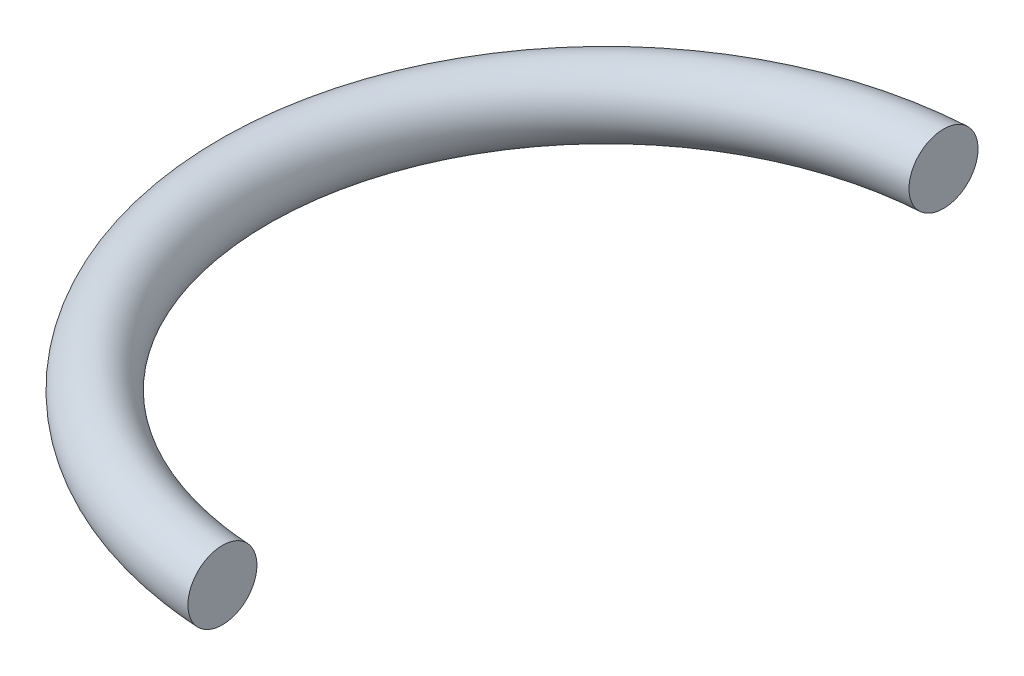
from build123d import *

# Parameters (mm, degrees)
ESQUISSE1_R                  = 1.525
ENL_V_MAT_EXTRU_1_DEPTH      = 25.830966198
ENL_V_MAT_EXTRU_1_DEPTH_BACK = 25.830966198


with BuildPart() as part:
    # Esquisse1 → Base-R_volution (revolve)
    with BuildSketch(Plane.XY, mode=Mode.PRIVATE) as base_r_volution_sk:
        with Locations((16, 0)):
            Circle(ESQUISSE1_R)
    revolve(base_r_volution_sk.sketch.rotate(Axis((0, 41.033377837, 0), (0, -1, 0)), 180.000000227), axis=Axis((0, 41.033377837, 0), (0, -1, 0)))

    # Esquisse2 → Enl_v. mat.-Extru.1 (cut, two sides: drawn at the far end of the back side and taken through both)
    with BuildSketch(Plane(origin=(0, 0, 0), x_dir=(1, 0, 0), z_dir=(0, 1, 0)).offset(-ENL_V_MAT_EXTRU_1_DEPTH_BACK)):
        Polygon((-1, 111.599114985), (-1, 18.773344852), (-1, -19.51351257), (-1, -112.339282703), (184.651540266, -112.339282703), (184.651540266, 111.599114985), align=None)
    extrude(amount=ENL_V_MAT_EXTRU_1_DEPTH + ENL_V_MAT_EXTRU_1_DEPTH_BACK, mode=Mode.SUBTRACT)


solid = part.part
